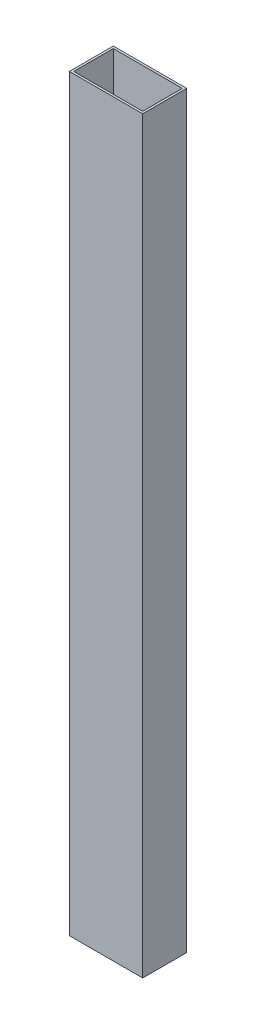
from build123d import *

# Parameters (mm, degrees)
SKETCH1_W           = 50
SKETCH1_H           = 30
BOSS_EXTRUDE1_DEPTH = 510
SHELL1_T            = -1.5


with BuildPart() as part:
    # Sketch1 → Boss-Extrude1 (new body)
    with BuildSketch(Plane(origin=(0, 0, 0), x_dir=(1, 0, 0), z_dir=(0, 1, 0))):
        Rectangle(SKETCH1_W, SKETCH1_H)
    extrude(amount=BOSS_EXTRUDE1_DEPTH)

    # Shell1
    shell1_openings = [part.faces().sort_by_distance(p)[0] for p in [
        (0, 510, 0),
        (0, 0, 0),
    ]]
    offset(amount=SHELL1_T, openings=shell1_openings, kind=Kind.INTERSECTION)


solid = part.part
